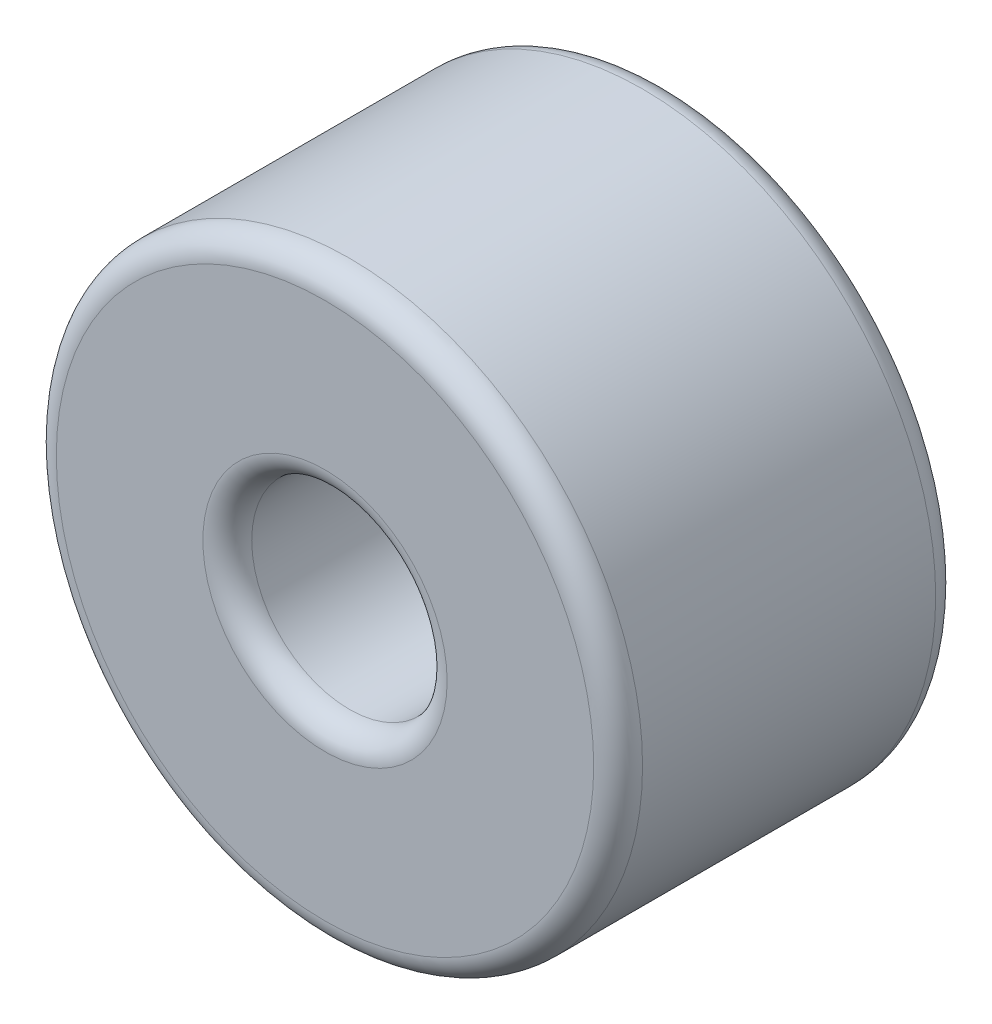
from build123d import *

# Parameters (mm, degrees)
SKIZZE1_R               = 12
SKIZZE1_R_2             = 4
LINEAR_AUSTRAGEN1_DEPTH = 7
VERRUNDUNG1_R           = 1
VERRUNDUNG2_R           = 1


with BuildPart() as part:
    # Skizze1 → Linear austragen1 (new, symmetric)
    with BuildSketch(Plane.XY):
        Circle(SKIZZE1_R)
        Circle(SKIZZE1_R_2, mode=Mode.SUBTRACT)
    extrude(amount=LINEAR_AUSTRAGEN1_DEPTH, both=True)

    # Verrundung1
    verrundung1_edges = [part.edges().sort_by_distance(p)[0] for p in [
        (-12, 0, -7),
        (-12, 0, 7),
    ]]
    fillet(verrundung1_edges, radius=VERRUNDUNG1_R)

    # Verrundung2
    verrundung2_edges = [part.edges().sort_by_distance(p)[0] for p in [
        (-4, 0, -7),
        (-4, 0, 7),
    ]]
    fillet(verrundung2_edges, radius=VERRUNDUNG2_R)


solid = part.part
